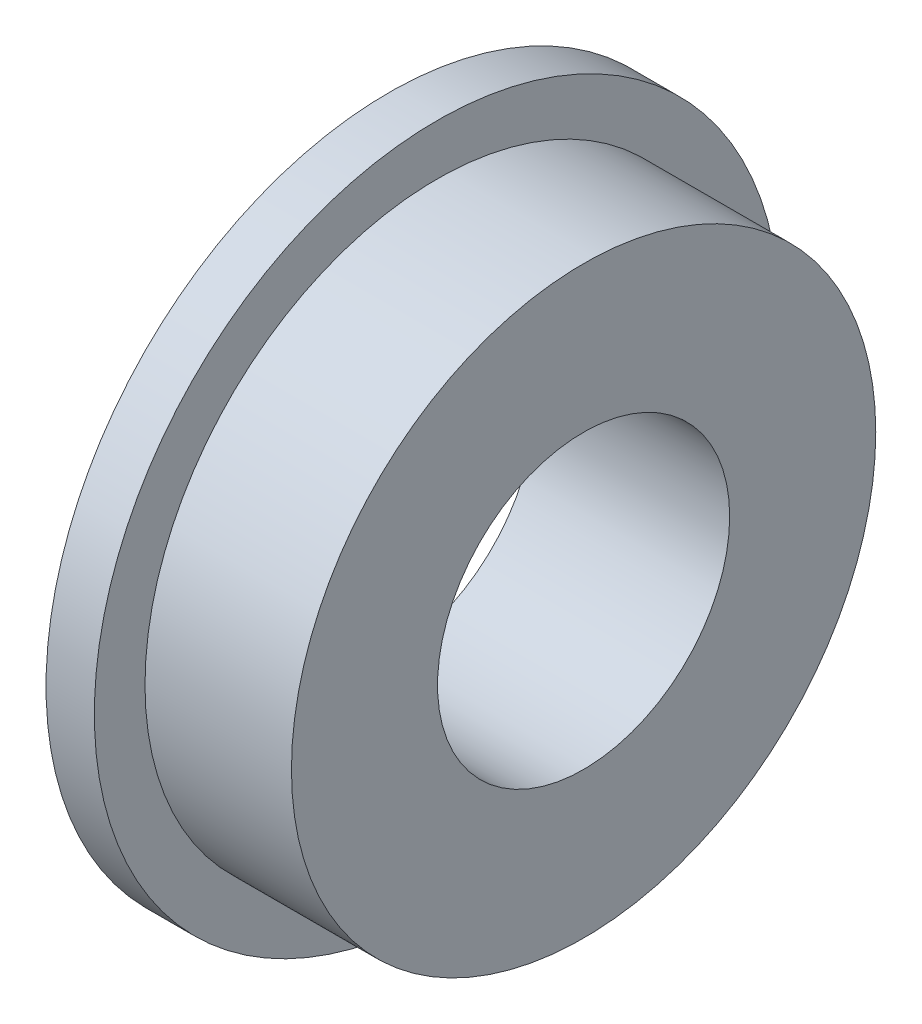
from build123d import *


with BuildPart() as part:
    # Sketch1 → Revolve1 (revolve)
    with BuildSketch(Plane.XY, mode=Mode.PRIVATE) as revolve1_sk:
        Polygon((0, 2.38125), (0, 4.7625), (-2.3876, 4.7625), (-2.3876, 5.588), (-3.175, 5.588), (-3.175, 2.38125), align=None)
    revolve(revolve1_sk.sketch.rotate(Axis((0, 0, 0), (-1, 0, 0)), 90), axis=Axis((0, 0, 0), (-1, 0, 0)))


solid = part.part
